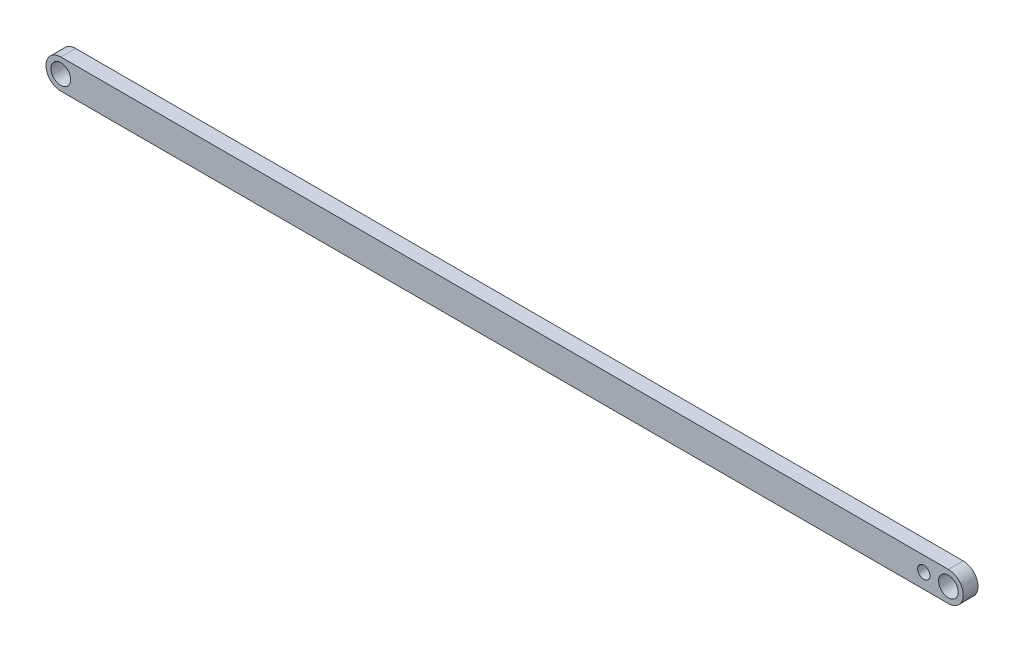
from build123d import *

# Parameters (mm, degrees)
ESQUISSE1_R             = 20
EXTRUSION1_DEPTH        = 30
ESQUISSE2_R             = 12.5
ENL_V_MAT_EXTRU_1_DEPTH = 1832.229095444


with BuildPart() as part:
    # Esquisse1 → Extrusion1 (new body)
    with BuildSketch(Plane.XY):
        with BuildLine():
            Line((0, 0), (1800, 0))
            ThreePointArc((1800, 0), (1830, 30), (1800, 60))
            Line((1800, 60), (0, 60))
            ThreePointArc((0, 60), (-30, 30), (0, 0))
        make_face()
        with Locations((0, 30)):
            Circle(ESQUISSE1_R, mode=Mode.SUBTRACT)
        with Locations((1800, 30)):
            Circle(ESQUISSE1_R, mode=Mode.SUBTRACT)
    extrude(amount=EXTRUSION1_DEPTH)

    # Esquisse2 → Enl_v. mat.-Extru.1 (cut, through all)
    with BuildSketch(Plane.XY.offset(30)):
        with Locations((1750, 30)):
            Circle(ESQUISSE2_R)
    extrude(amount=-ENL_V_MAT_EXTRU_1_DEPTH, mode=Mode.SUBTRACT)


solid = part.part
